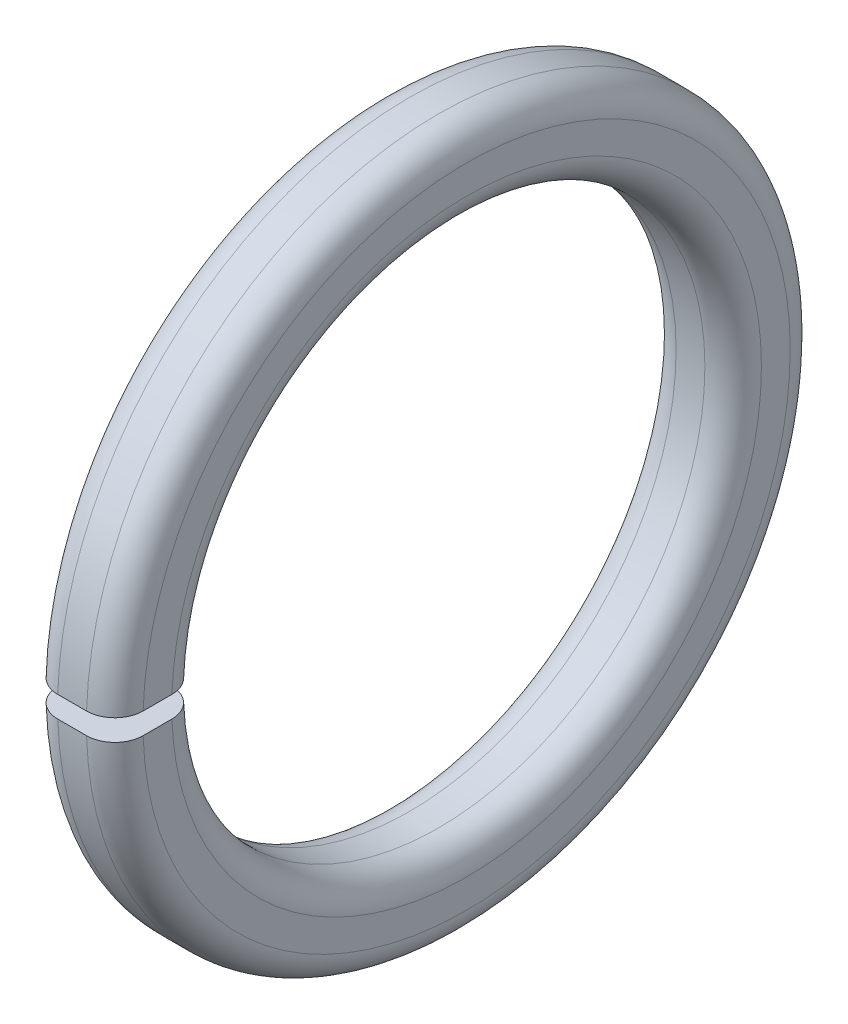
from build123d import *

# Parameters (mm, degrees)
SKETCH2_W = 2
SKETCH2_H = 33.66
GAP_DEPTH = 48.349762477


with BuildPart() as part:
    # Sketch1 → Base-Revolve (revolve)
    with BuildSketch(Plane.XY, mode=Mode.PRIVATE) as base_revolve_sk:
        with BuildLine():
            Line((0, 27.65), (0, 30.35))
            ThreePointArc((0, 30.35), (-0.77616703, 32.22383297), (-2.65, 33))
            Line((-2.65, 33), (-5.35, 33))
            ThreePointArc((-5.35, 33), (-7.22383297, 32.22383297), (-8, 30.35))
            Line((-8, 30.35), (-8, 27.65))
            ThreePointArc((-8, 27.65), (-7.22383297, 25.77616703), (-5.35, 25))
            Line((-5.35, 25), (-2.65, 25))
            ThreePointArc((-2.65, 25), (-0.77616703, 25.77616703), (0, 27.65))
        make_face()
    revolve(base_revolve_sk.sketch.rotate(Axis((-34.925, 0, 0), (1, 0, 0)), 90), axis=Axis((-34.925, 0, 0), (1, 0, 0)))

    # Sketch2 → Gap (cut, through all)
    with BuildSketch(Plane(origin=(0, 0, 0), x_dir=(0, -1, 0), z_dir=(-1, 0, 0))):
        with Locations((0, 16.83)):
            Rectangle(SKETCH2_W, SKETCH2_H)
    extrude(amount=GAP_DEPTH, mode=Mode.SUBTRACT)


solid = part.part
